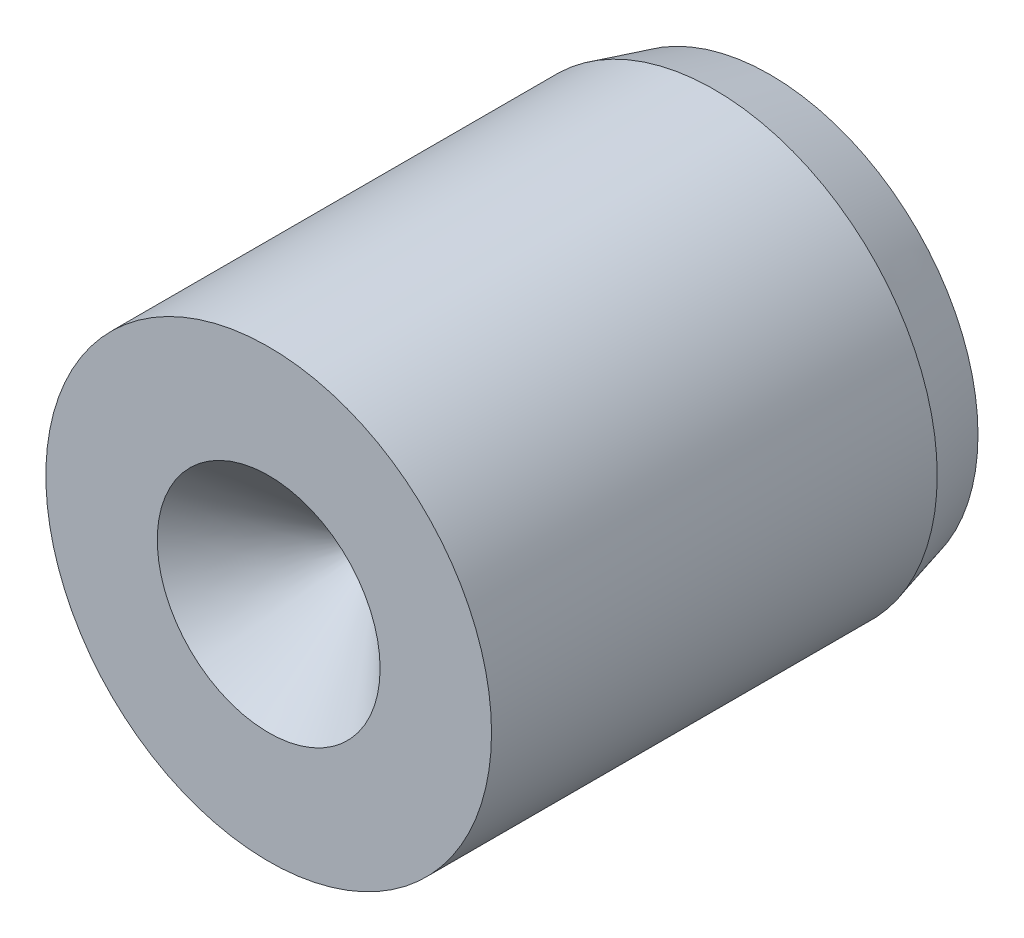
ISO-10303-21;
HEADER;
FILE_DESCRIPTION(('STEP AP214'),'2;1');
FILE_NAME('part.step','',(''),(''),'','','');
FILE_SCHEMA(('AUTOMOTIVE_DESIGN { 1 0 10303 214 1 1 1 1 }'));
ENDSEC;
DATA;
#1=APPLICATION_CONTEXT('core data for automotive mechanical design processes');
#2=APPLICATION_PROTOCOL_DEFINITION('international standard','automotive_design',2000,#1);
#3=PRODUCT_CONTEXT('',#1,'mechanical');
#4=PRODUCT('Part','Part','',(#3));
#5=PRODUCT_RELATED_PRODUCT_CATEGORY('part','',(#4));
#6=PRODUCT_DEFINITION_FORMATION('','',#4);
#7=PRODUCT_DEFINITION_CONTEXT('part definition',#1,'design');
#8=PRODUCT_DEFINITION('design','',#6,#7);
#9=PRODUCT_DEFINITION_SHAPE('','',#8);
#10=(LENGTH_UNIT() NAMED_UNIT(*) SI_UNIT(.MILLI.,.METRE.));
#11=(NAMED_UNIT(*) PLANE_ANGLE_UNIT() SI_UNIT($,.RADIAN.));
#12=(NAMED_UNIT(*) SI_UNIT($,.STERADIAN.) SOLID_ANGLE_UNIT());
#13=UNCERTAINTY_MEASURE_WITH_UNIT(LENGTH_MEASURE(1.E-05),#10,'distance_accuracy_value','');
#14=(GEOMETRIC_REPRESENTATION_CONTEXT(3) GLOBAL_UNCERTAINTY_ASSIGNED_CONTEXT((#13)) GLOBAL_UNIT_ASSIGNED_CONTEXT((#10,
#11,#12)) REPRESENTATION_CONTEXT('',''));
#15=CARTESIAN_POINT('',(0.,0.,0.));
#16=DIRECTION('',(0.,0.,1.));
#17=DIRECTION('',(1.,0.,0.));
#18=AXIS2_PLACEMENT_3D('',#15,#16,#17);
#19=CARTESIAN_POINT('',(0.,8.,18.));
#20=DIRECTION('',(0.,0.,-1.));
#21=DIRECTION('',(-1.,0.,0.));
#22=AXIS2_PLACEMENT_3D('',#19,#20,#21);
#23=PLANE('',#22);
#24=CARTESIAN_POINT('',(0.,0.,18.));
#25=DIRECTION('',(0.,0.,1.));
#26=DIRECTION('',(1.,0.,0.));
#27=AXIS2_PLACEMENT_3D('',#24,#25,#26);
#28=CIRCLE('',#27,4.);
#29=CARTESIAN_POINT('',(4.,0.,18.));
#30=VERTEX_POINT('',#29);
#31=EDGE_CURVE('E9',#30,#30,#28,.T.);
#32=ORIENTED_EDGE('',*,*,#31,.F.);
#33=EDGE_LOOP('',(#32));
#34=FACE_BOUND('',#33,.T.);
#35=CARTESIAN_POINT('',(0.,0.,18.));
#36=DIRECTION('',(0.,0.,1.));
#37=DIRECTION('',(1.,0.,0.));
#38=AXIS2_PLACEMENT_3D('',#35,#36,#37);
#39=CIRCLE('',#38,8.);
#40=CARTESIAN_POINT('',(8.,0.,18.));
#41=VERTEX_POINT('',#40);
#42=EDGE_CURVE('E33',#41,#41,#39,.T.);
#43=ORIENTED_EDGE('',*,*,#42,.T.);
#44=EDGE_LOOP('',(#43));
#45=FACE_BOUND('',#44,.T.);
#46=ADVANCED_FACE('F14',(#34,#45),#23,.F.);
#47=CARTESIAN_POINT('',(0.,0.,18.));
#48=DIRECTION('',(0.,0.,1.));
#49=DIRECTION('',(1.,0.,0.));
#50=AXIS2_PLACEMENT_3D('',#47,#48,#49);
#51=CONICAL_SURFACE('',#50,4.,0.78539816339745);
#52=CARTESIAN_POINT('',(0.,0.,14.));
#53=VERTEX_POINT('',#52);
#54=VERTEX_LOOP('',#53);
#55=FACE_BOUND('',#54,.T.);
#56=ORIENTED_EDGE('',*,*,#31,.T.);
#57=EDGE_LOOP('',(#56));
#58=FACE_BOUND('',#57,.T.);
#59=ADVANCED_FACE('F23',(#55,#58),#51,.F.);
#60=CARTESIAN_POINT('',(0.,7.46410161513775,0.));
#61=DIRECTION('',(0.,0.,-1.));
#62=DIRECTION('',(-1.,0.,0.));
#63=AXIS2_PLACEMENT_3D('',#60,#61,#62);
#64=PLANE('',#63);
#65=CARTESIAN_POINT('',(0.,0.,0.));
#66=DIRECTION('',(0.,0.,1.));
#67=DIRECTION('',(1.,0.,0.));
#68=AXIS2_PLACEMENT_3D('',#65,#66,#67);
#69=CIRCLE('',#68,7.46410161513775);
#70=CARTESIAN_POINT('',(7.46410161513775,0.,0.));
#71=VERTEX_POINT('',#70);
#72=EDGE_CURVE('E20',#71,#71,#69,.T.);
#73=ORIENTED_EDGE('',*,*,#72,.F.);
#74=EDGE_LOOP('',(#73));
#75=FACE_BOUND('',#74,.T.);
#76=ADVANCED_FACE('F26',(#75),#64,.T.);
#77=CARTESIAN_POINT('',(0.,0.,2.));
#78=DIRECTION('',(0.,0.,1.));
#79=DIRECTION('',(1.,0.,0.));
#80=AXIS2_PLACEMENT_3D('',#77,#78,#79);
#81=CONICAL_SURFACE('',#80,8.,0.26179938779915);
#82=ORIENTED_EDGE('',*,*,#72,.T.);
#83=EDGE_LOOP('',(#82));
#84=FACE_BOUND('',#83,.T.);
#85=CARTESIAN_POINT('',(0.,0.,2.));
#86=DIRECTION('',(0.,0.,1.));
#87=DIRECTION('',(1.,0.,0.));
#88=AXIS2_PLACEMENT_3D('',#85,#86,#87);
#89=CIRCLE('',#88,8.);
#90=CARTESIAN_POINT('',(8.,0.,2.));
#91=VERTEX_POINT('',#90);
#92=EDGE_CURVE('E35',#91,#91,#89,.T.);
#93=ORIENTED_EDGE('',*,*,#92,.F.);
#94=EDGE_LOOP('',(#93));
#95=FACE_BOUND('',#94,.T.);
#96=ADVANCED_FACE('F42',(#84,#95),#81,.T.);
#97=CARTESIAN_POINT('',(0.,0.,7.));
#98=DIRECTION('',(0.,0.,1.));
#99=DIRECTION('',(1.,0.,0.));
#100=AXIS2_PLACEMENT_3D('',#97,#98,#99);
#101=CYLINDRICAL_SURFACE('',#100,8.);
#102=ORIENTED_EDGE('',*,*,#92,.T.);
#103=EDGE_LOOP('',(#102));
#104=FACE_BOUND('',#103,.T.);
#105=ORIENTED_EDGE('',*,*,#42,.F.);
#106=EDGE_LOOP('',(#105));
#107=FACE_BOUND('',#106,.T.);
#108=ADVANCED_FACE('F51',(#104,#107),#101,.T.);
#109=CLOSED_SHELL('',(#46,#59,#76,#96,#108));
#110=MANIFOLD_SOLID_BREP('B1',#109);
#111=ADVANCED_BREP_SHAPE_REPRESENTATION('',(#18,#110),#14);
#112=SHAPE_DEFINITION_REPRESENTATION(#9,#111);
ENDSEC;
END-ISO-10303-21;
